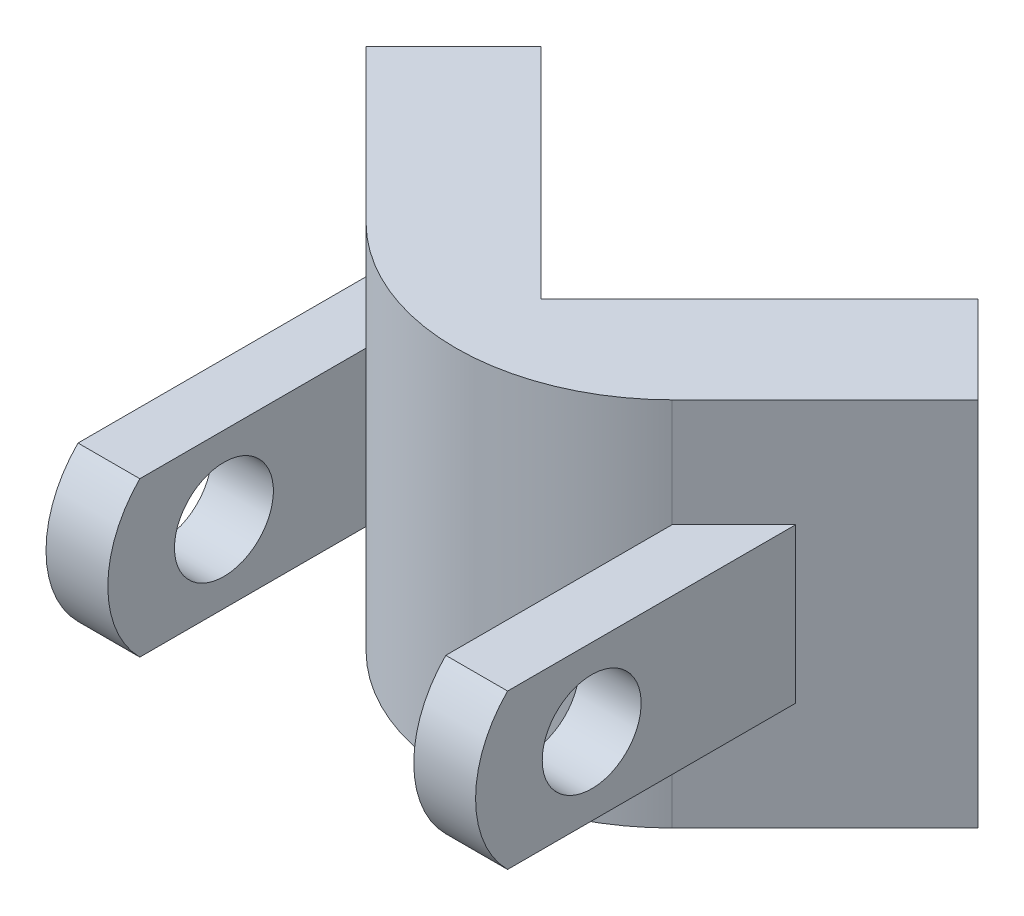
ISO-10303-21;
HEADER;
FILE_DESCRIPTION(('STEP AP214'),'2;1');
FILE_NAME('part.step','',(''),(''),'','','');
FILE_SCHEMA(('AUTOMOTIVE_DESIGN { 1 0 10303 214 1 1 1 1 }'));
ENDSEC;
DATA;
#1=APPLICATION_CONTEXT('core data for automotive mechanical design processes');
#2=APPLICATION_PROTOCOL_DEFINITION('international standard','automotive_design',2000,#1);
#3=PRODUCT_CONTEXT('',#1,'mechanical');
#4=PRODUCT('Part','Part','',(#3));
#5=PRODUCT_RELATED_PRODUCT_CATEGORY('part','',(#4));
#6=PRODUCT_DEFINITION_FORMATION('','',#4);
#7=PRODUCT_DEFINITION_CONTEXT('part definition',#1,'design');
#8=PRODUCT_DEFINITION('design','',#6,#7);
#9=PRODUCT_DEFINITION_SHAPE('','',#8);
#10=(LENGTH_UNIT() NAMED_UNIT(*) SI_UNIT(.MILLI.,.METRE.));
#11=(NAMED_UNIT(*) PLANE_ANGLE_UNIT() SI_UNIT($,.RADIAN.));
#12=(NAMED_UNIT(*) SI_UNIT($,.STERADIAN.) SOLID_ANGLE_UNIT());
#13=UNCERTAINTY_MEASURE_WITH_UNIT(LENGTH_MEASURE(1.E-05),#10,'distance_accuracy_value','');
#14=(GEOMETRIC_REPRESENTATION_CONTEXT(3) GLOBAL_UNCERTAINTY_ASSIGNED_CONTEXT((#13)) GLOBAL_UNIT_ASSIGNED_CONTEXT((#10,
#11,#12)) REPRESENTATION_CONTEXT('',''));
#15=CARTESIAN_POINT('',(0.,0.,0.));
#16=DIRECTION('',(0.,0.,1.));
#17=DIRECTION('',(1.,0.,0.));
#18=AXIS2_PLACEMENT_3D('',#15,#16,#17);
#19=CARTESIAN_POINT('',(0.,15.24,14.3684097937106));
#20=DIRECTION('',(-0.707106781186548,0.,0.707106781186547));
#21=DIRECTION('',(0.707106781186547,0.,0.707106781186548));
#22=AXIS2_PLACEMENT_3D('',#19,#20,#21);
#23=PLANE('',#22);
#24=DIRECTION('',(-0.707106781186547,0.,-0.707106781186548));
#25=VECTOR('',#24,1.);
#26=CARTESIAN_POINT('',(0.,-15.24,14.3684097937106));
#27=LINE('',#26,#25);
#28=CARTESIAN_POINT('',(-12.5723585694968,-15.24,1.79605122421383));
#29=VERTEX_POINT('',#28);
#30=CARTESIAN_POINT('',(-25.1447171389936,-15.24,-10.776307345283));
#31=VERTEX_POINT('',#30);
#32=EDGE_CURVE('E235',#29,#31,#27,.T.);
#33=ORIENTED_EDGE('',*,*,#32,.F.);
#34=DIRECTION('',(0.,1.,0.));
#35=VECTOR('',#34,1.);
#36=CARTESIAN_POINT('',(-12.5723585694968,-15.24,1.79605122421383));
#37=LINE('',#36,#35);
#38=CARTESIAN_POINT('',(-12.5723585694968,-6.35000000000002,1.79605122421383));
#39=VERTEX_POINT('',#38);
#40=EDGE_CURVE('E283',#29,#39,#37,.T.);
#41=ORIENTED_EDGE('',*,*,#40,.T.);
#42=DIRECTION('',(-0.707106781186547,0.,-0.707106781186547));
#43=VECTOR('',#42,1.);
#44=CARTESIAN_POINT('',(-17.6523585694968,-6.35000000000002,-3.28394877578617));
#45=LINE('',#44,#43);
#46=CARTESIAN_POINT('',(-17.6523585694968,-6.35000000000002,-3.28394877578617));
#47=VERTEX_POINT('',#46);
#48=EDGE_CURVE('E185',#39,#47,#45,.T.);
#49=ORIENTED_EDGE('',*,*,#48,.T.);
#50=DIRECTION('',(0.,-1.,0.));
#51=VECTOR('',#50,1.);
#52=CARTESIAN_POINT('',(-17.6523585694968,6.35000000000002,-3.28394877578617));
#53=LINE('',#52,#51);
#54=CARTESIAN_POINT('',(-17.6523585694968,6.35000000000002,-3.28394877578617));
#55=VERTEX_POINT('',#54);
#56=EDGE_CURVE('E196',#55,#47,#53,.T.);
#57=ORIENTED_EDGE('',*,*,#56,.F.);
#58=DIRECTION('',(-0.707106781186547,0.,-0.707106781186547));
#59=VECTOR('',#58,1.);
#60=CARTESIAN_POINT('',(-17.6523585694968,6.35000000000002,-3.28394877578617));
#61=LINE('',#60,#59);
#62=CARTESIAN_POINT('',(-12.5723585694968,6.35000000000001,1.79605122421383));
#63=VERTEX_POINT('',#62);
#64=EDGE_CURVE('E173',#63,#55,#61,.T.);
#65=ORIENTED_EDGE('',*,*,#64,.F.);
#66=CARTESIAN_POINT('',(-12.5723585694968,15.24,1.79605122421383));
#67=VERTEX_POINT('',#66);
#68=EDGE_CURVE('E289',#63,#67,#37,.T.);
#69=ORIENTED_EDGE('',*,*,#68,.T.);
#70=DIRECTION('',(-0.707106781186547,0.,-0.707106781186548));
#71=VECTOR('',#70,1.);
#72=CARTESIAN_POINT('',(0.,15.24,14.3684097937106));
#73=LINE('',#72,#71);
#74=CARTESIAN_POINT('',(-25.1447171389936,15.24,-10.776307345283));
#75=VERTEX_POINT('',#74);
#76=EDGE_CURVE('E213',#67,#75,#73,.T.);
#77=ORIENTED_EDGE('',*,*,#76,.T.);
#78=DIRECTION('',(0.,-1.,0.));
#79=VECTOR('',#78,1.);
#80=CARTESIAN_POINT('',(-25.1447171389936,15.24,-10.776307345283));
#81=LINE('',#80,#79);
#82=EDGE_CURVE('E252',#75,#31,#81,.T.);
#83=ORIENTED_EDGE('',*,*,#82,.T.);
#84=EDGE_LOOP('',(#33,#41,#49,#57,#65,#69,#77,#83));
#85=FACE_BOUND('',#84,.T.);
#86=ADVANCED_FACE('F44',(#85),#23,.T.);
#87=CARTESIAN_POINT('',(25.1447171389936,15.24,-10.776307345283));
#88=DIRECTION('',(0.707106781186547,0.,0.707106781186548));
#89=DIRECTION('',(0.707106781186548,0.,-0.707106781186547));
#90=AXIS2_PLACEMENT_3D('',#87,#88,#89);
#91=PLANE('',#90);
#92=DIRECTION('',(-0.707106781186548,0.,0.707106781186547));
#93=VECTOR('',#92,1.);
#94=CARTESIAN_POINT('',(25.1447171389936,15.24,-10.776307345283));
#95=LINE('',#94,#93);
#96=CARTESIAN_POINT('',(25.1447171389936,15.24,-10.776307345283));
#97=VERTEX_POINT('',#96);
#98=CARTESIAN_POINT('',(12.5723585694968,15.24,1.79605122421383));
#99=VERTEX_POINT('',#98);
#100=EDGE_CURVE('E209',#97,#99,#95,.T.);
#101=ORIENTED_EDGE('',*,*,#100,.T.);
#102=DIRECTION('',(0.,1.,0.));
#103=VECTOR('',#102,1.);
#104=CARTESIAN_POINT('',(12.5723585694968,-15.24,1.79605122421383));
#105=LINE('',#104,#103);
#106=CARTESIAN_POINT('',(12.5723585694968,6.35000000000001,1.79605122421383));
#107=VERTEX_POINT('',#106);
#108=EDGE_CURVE('E347',#107,#99,#105,.T.);
#109=ORIENTED_EDGE('',*,*,#108,.F.);
#110=DIRECTION('',(-0.707106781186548,0.,0.707106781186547));
#111=VECTOR('',#110,1.);
#112=CARTESIAN_POINT('',(25.1447171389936,6.35000000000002,-10.776307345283));
#113=LINE('',#112,#111);
#114=CARTESIAN_POINT('',(17.6523585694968,6.35000000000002,-3.28394877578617));
#115=VERTEX_POINT('',#114);
#116=EDGE_CURVE('E53',#115,#107,#113,.T.);
#117=ORIENTED_EDGE('',*,*,#116,.F.);
#118=DIRECTION('',(0.,-1.,0.));
#119=VECTOR('',#118,1.);
#120=CARTESIAN_POINT('',(17.6523585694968,15.24,-3.28394877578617));
#121=LINE('',#120,#119);
#122=CARTESIAN_POINT('',(17.6523585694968,-6.35000000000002,-3.28394877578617));
#123=VERTEX_POINT('',#122);
#124=EDGE_CURVE('E264',#115,#123,#121,.T.);
#125=ORIENTED_EDGE('',*,*,#124,.T.);
#126=DIRECTION('',(-0.707106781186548,0.,0.707106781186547));
#127=VECTOR('',#126,1.);
#128=CARTESIAN_POINT('',(25.1447171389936,-6.35000000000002,-10.776307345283));
#129=LINE('',#128,#127);
#130=CARTESIAN_POINT('',(12.5723585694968,-6.35000000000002,1.79605122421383));
#131=VERTEX_POINT('',#130);
#132=EDGE_CURVE('E248',#123,#131,#129,.T.);
#133=ORIENTED_EDGE('',*,*,#132,.T.);
#134=CARTESIAN_POINT('',(12.5723585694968,-15.24,1.79605122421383));
#135=VERTEX_POINT('',#134);
#136=EDGE_CURVE('E322',#135,#131,#105,.T.);
#137=ORIENTED_EDGE('',*,*,#136,.F.);
#138=DIRECTION('',(-0.707106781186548,0.,0.707106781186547));
#139=VECTOR('',#138,1.);
#140=CARTESIAN_POINT('',(25.1447171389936,-15.24,-10.776307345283));
#141=LINE('',#140,#139);
#142=CARTESIAN_POINT('',(25.1447171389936,-15.24,-10.776307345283));
#143=VERTEX_POINT('',#142);
#144=EDGE_CURVE('E231',#143,#135,#141,.T.);
#145=ORIENTED_EDGE('',*,*,#144,.F.);
#146=DIRECTION('',(0.,-1.,0.));
#147=VECTOR('',#146,1.);
#148=CARTESIAN_POINT('',(25.1447171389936,15.24,-10.776307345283));
#149=LINE('',#148,#147);
#150=EDGE_CURVE('E256',#97,#143,#149,.T.);
#151=ORIENTED_EDGE('',*,*,#150,.F.);
#152=EDGE_LOOP('',(#101,#109,#117,#125,#133,#137,#145,#151));
#153=FACE_BOUND('',#152,.T.);
#154=ADVANCED_FACE('F320',(#153),#91,.T.);
#155=CARTESIAN_POINT('',(0.,15.24,0.));
#156=DIRECTION('',(0.,-1.,0.));
#157=DIRECTION('',(0.,0.,-1.));
#158=AXIS2_PLACEMENT_3D('',#155,#156,#157);
#159=PLANE('',#158);
#160=CARTESIAN_POINT('',(0.,15.24,-10.7920889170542));
#161=DIRECTION('',(0.,1.,0.));
#162=DIRECTION('',(0.,0.,1.));
#163=AXIS2_PLACEMENT_3D('',#160,#161,#162);
#164=CIRCLE('',#163,17.7911627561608);
#165=EDGE_CURVE('E339',#67,#99,#164,.T.);
#166=ORIENTED_EDGE('',*,*,#165,.T.);
#167=ORIENTED_EDGE('',*,*,#100,.F.);
#168=DIRECTION('',(0.707106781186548,0.,0.707106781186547));
#169=VECTOR('',#168,1.);
#170=CARTESIAN_POINT('',(17.9605122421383,15.24,-17.9605122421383));
#171=LINE('',#170,#169);
#172=CARTESIAN_POINT('',(17.9605122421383,15.24,-17.9605122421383));
#173=VERTEX_POINT('',#172);
#174=EDGE_CURVE('E204',#173,#97,#171,.T.);
#175=ORIENTED_EDGE('',*,*,#174,.F.);
#176=DIRECTION('',(0.707106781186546,0.,-0.707106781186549));
#177=VECTOR('',#176,1.);
#178=CARTESIAN_POINT('',(0.,15.24,0.));
#179=LINE('',#178,#177);
#180=CARTESIAN_POINT('',(0.,15.24,0.));
#181=VERTEX_POINT('',#180);
#182=EDGE_CURVE('E200',#181,#173,#179,.T.);
#183=ORIENTED_EDGE('',*,*,#182,.F.);
#184=DIRECTION('',(-0.707106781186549,0.,-0.707106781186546));
#185=VECTOR('',#184,1.);
#186=CARTESIAN_POINT('',(0.,15.24,0.));
#187=LINE('',#186,#185);
#188=CARTESIAN_POINT('',(-17.9605122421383,15.24,-17.9605122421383));
#189=VERTEX_POINT('',#188);
#190=EDGE_CURVE('E220',#181,#189,#187,.T.);
#191=ORIENTED_EDGE('',*,*,#190,.T.);
#192=DIRECTION('',(0.707106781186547,0.,-0.707106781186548));
#193=VECTOR('',#192,1.);
#194=CARTESIAN_POINT('',(-25.1447171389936,15.24,-10.776307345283));
#195=LINE('',#194,#193);
#196=EDGE_CURVE('E216',#75,#189,#195,.T.);
#197=ORIENTED_EDGE('',*,*,#196,.F.);
#198=ORIENTED_EDGE('',*,*,#76,.F.);
#199=EDGE_LOOP('',(#166,#167,#175,#183,#191,#197,#198));
#200=FACE_BOUND('',#199,.T.);
#201=ADVANCED_FACE('F359',(#200),#159,.F.);
#202=CARTESIAN_POINT('',(0.,-15.24,0.));
#203=DIRECTION('',(0.,-1.,0.));
#204=DIRECTION('',(0.,0.,-1.));
#205=AXIS2_PLACEMENT_3D('',#202,#203,#204);
#206=PLANE('',#205);
#207=ORIENTED_EDGE('',*,*,#144,.T.);
#208=CARTESIAN_POINT('',(0.,-15.24,-10.7920889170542));
#209=DIRECTION('',(0.,1.,0.));
#210=DIRECTION('',(0.,0.,1.));
#211=AXIS2_PLACEMENT_3D('',#208,#209,#210);
#212=CIRCLE('',#211,17.7911627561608);
#213=EDGE_CURVE('E344',#29,#135,#212,.T.);
#214=ORIENTED_EDGE('',*,*,#213,.F.);
#215=ORIENTED_EDGE('',*,*,#32,.T.);
#216=DIRECTION('',(0.707106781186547,0.,-0.707106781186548));
#217=VECTOR('',#216,1.);
#218=CARTESIAN_POINT('',(-25.1447171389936,-15.24,-10.776307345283));
#219=LINE('',#218,#217);
#220=CARTESIAN_POINT('',(-17.9605122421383,-15.24,-17.9605122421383));
#221=VERTEX_POINT('',#220);
#222=EDGE_CURVE('E238',#31,#221,#219,.T.);
#223=ORIENTED_EDGE('',*,*,#222,.T.);
#224=DIRECTION('',(-0.707106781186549,0.,-0.707106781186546));
#225=VECTOR('',#224,1.);
#226=CARTESIAN_POINT('',(0.,-15.24,0.));
#227=LINE('',#226,#225);
#228=CARTESIAN_POINT('',(0.,-15.24,0.));
#229=VERTEX_POINT('',#228);
#230=EDGE_CURVE('E205',#229,#221,#227,.T.);
#231=ORIENTED_EDGE('',*,*,#230,.F.);
#232=DIRECTION('',(0.707106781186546,0.,-0.707106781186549));
#233=VECTOR('',#232,1.);
#234=CARTESIAN_POINT('',(0.,-15.24,0.));
#235=LINE('',#234,#233);
#236=CARTESIAN_POINT('',(17.9605122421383,-15.24,-17.9605122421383));
#237=VERTEX_POINT('',#236);
#238=EDGE_CURVE('E199',#229,#237,#235,.T.);
#239=ORIENTED_EDGE('',*,*,#238,.T.);
#240=DIRECTION('',(0.707106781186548,0.,0.707106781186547));
#241=VECTOR('',#240,1.);
#242=CARTESIAN_POINT('',(17.9605122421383,-15.24,-17.9605122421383));
#243=LINE('',#242,#241);
#244=EDGE_CURVE('E227',#237,#143,#243,.T.);
#245=ORIENTED_EDGE('',*,*,#244,.T.);
#246=EDGE_LOOP('',(#207,#214,#215,#223,#231,#239,#245));
#247=FACE_BOUND('',#246,.T.);
#248=ADVANCED_FACE('F422',(#247),#206,.T.);
#249=CARTESIAN_POINT('',(0.,15.24,0.));
#250=DIRECTION('',(-0.707106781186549,0.,-0.707106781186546));
#251=DIRECTION('',(-0.707106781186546,0.,0.707106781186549));
#252=AXIS2_PLACEMENT_3D('',#249,#250,#251);
#253=PLANE('',#252);
#254=ORIENTED_EDGE('',*,*,#238,.F.);
#255=DIRECTION('',(0.,-1.,0.));
#256=VECTOR('',#255,1.);
#257=CARTESIAN_POINT('',(0.,15.24,0.));
#258=LINE('',#257,#256);
#259=EDGE_CURVE('E245',#181,#229,#258,.T.);
#260=ORIENTED_EDGE('',*,*,#259,.F.);
#261=ORIENTED_EDGE('',*,*,#182,.T.);
#262=DIRECTION('',(0.,-1.,0.));
#263=VECTOR('',#262,1.);
#264=CARTESIAN_POINT('',(17.9605122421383,15.24,-17.9605122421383));
#265=LINE('',#264,#263);
#266=EDGE_CURVE('E223',#173,#237,#265,.T.);
#267=ORIENTED_EDGE('',*,*,#266,.T.);
#268=EDGE_LOOP('',(#254,#260,#261,#267));
#269=FACE_BOUND('',#268,.T.);
#270=ADVANCED_FACE('F46',(#269),#253,.T.);
#271=CARTESIAN_POINT('',(0.,15.24,0.));
#272=DIRECTION('',(-0.707106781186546,0.,0.707106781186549));
#273=DIRECTION('',(0.707106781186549,0.,0.707106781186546));
#274=AXIS2_PLACEMENT_3D('',#271,#272,#273);
#275=PLANE('',#274);
#276=ORIENTED_EDGE('',*,*,#230,.T.);
#277=DIRECTION('',(0.,-1.,0.));
#278=VECTOR('',#277,1.);
#279=CARTESIAN_POINT('',(-17.9605122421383,15.24,-17.9605122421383));
#280=LINE('',#279,#278);
#281=EDGE_CURVE('E249',#189,#221,#280,.T.);
#282=ORIENTED_EDGE('',*,*,#281,.F.);
#283=ORIENTED_EDGE('',*,*,#190,.F.);
#284=ORIENTED_EDGE('',*,*,#259,.T.);
#285=EDGE_LOOP('',(#276,#282,#283,#284));
#286=FACE_BOUND('',#285,.T.);
#287=ADVANCED_FACE('F372',(#286),#275,.F.);
#288=CARTESIAN_POINT('',(-25.1447171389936,15.24,-10.776307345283));
#289=DIRECTION('',(-0.707106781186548,0.,-0.707106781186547));
#290=DIRECTION('',(-0.707106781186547,0.,0.707106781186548));
#291=AXIS2_PLACEMENT_3D('',#288,#289,#290);
#292=PLANE('',#291);
#293=ORIENTED_EDGE('',*,*,#222,.F.);
#294=ORIENTED_EDGE('',*,*,#82,.F.);
#295=ORIENTED_EDGE('',*,*,#196,.T.);
#296=ORIENTED_EDGE('',*,*,#281,.T.);
#297=EDGE_LOOP('',(#293,#294,#295,#296));
#298=FACE_BOUND('',#297,.T.);
#299=ADVANCED_FACE('F376',(#298),#292,.T.);
#300=CARTESIAN_POINT('',(17.9605122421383,15.24,-17.9605122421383));
#301=DIRECTION('',(0.707106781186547,0.,-0.707106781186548));
#302=DIRECTION('',(-0.707106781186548,0.,-0.707106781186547));
#303=AXIS2_PLACEMENT_3D('',#300,#301,#302);
#304=PLANE('',#303);
#305=ORIENTED_EDGE('',*,*,#244,.F.);
#306=ORIENTED_EDGE('',*,*,#266,.F.);
#307=ORIENTED_EDGE('',*,*,#174,.T.);
#308=ORIENTED_EDGE('',*,*,#150,.T.);
#309=EDGE_LOOP('',(#305,#306,#307,#308));
#310=FACE_BOUND('',#309,.T.);
#311=ADVANCED_FACE('F364',(#310),#304,.T.);
#312=CARTESIAN_POINT('',(-17.6523585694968,6.35000000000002,24.6560512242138));
#313=DIRECTION('',(1.,0.,0.));
#314=DIRECTION('',(0.,0.,-1.));
#315=AXIS2_PLACEMENT_3D('',#312,#313,#314);
#316=PLANE('',#315);
#317=CARTESIAN_POINT('',(-17.6523585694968,0.,13.4800512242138));
#318=DIRECTION('',(-1.,0.,0.));
#319=DIRECTION('',(0.,0.,1.));
#320=AXIS2_PLACEMENT_3D('',#317,#318,#319);
#321=CIRCLE('',#320,4.064);
#322=CARTESIAN_POINT('',(-17.6523585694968,0.,17.5440512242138));
#323=VERTEX_POINT('',#322);
#324=EDGE_CURVE('E274',#323,#323,#321,.T.);
#325=ORIENTED_EDGE('',*,*,#324,.F.);
#326=EDGE_LOOP('',(#325));
#327=FACE_BOUND('',#326,.T.);
#328=DIRECTION('',(0.,0.,1.));
#329=VECTOR('',#328,1.);
#330=CARTESIAN_POINT('',(-17.6523585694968,-6.35000000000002,24.6560512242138));
#331=LINE('',#330,#329);
#332=CARTESIAN_POINT('',(-17.6523585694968,-6.35000000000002,20.3917774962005));
#333=VERTEX_POINT('',#332);
#334=EDGE_CURVE('E168',#47,#333,#331,.T.);
#335=ORIENTED_EDGE('',*,*,#334,.T.);
#336=CARTESIAN_POINT('',(-17.6523585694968,0.,14.0417774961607));
#337=DIRECTION('',(1.,0.,0.));
#338=DIRECTION('',(0.,0.,-1.));
#339=AXIS2_PLACEMENT_3D('',#336,#337,#338);
#340=CIRCLE('',#339,8.9802561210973);
#341=CARTESIAN_POINT('',(-17.6523585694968,6.35000000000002,20.3917774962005));
#342=VERTEX_POINT('',#341);
#343=EDGE_CURVE('E60',#342,#333,#340,.T.);
#344=ORIENTED_EDGE('',*,*,#343,.F.);
#345=DIRECTION('',(0.,0.,1.));
#346=VECTOR('',#345,1.);
#347=CARTESIAN_POINT('',(-17.6523585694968,6.35000000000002,24.6560512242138));
#348=LINE('',#347,#346);
#349=EDGE_CURVE('E165',#55,#342,#348,.T.);
#350=ORIENTED_EDGE('',*,*,#349,.F.);
#351=ORIENTED_EDGE('',*,*,#56,.T.);
#352=EDGE_LOOP('',(#335,#344,#350,#351));
#353=FACE_BOUND('',#352,.T.);
#354=ADVANCED_FACE('F163',(#327,#353),#316,.F.);
#355=CARTESIAN_POINT('',(-12.5723585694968,6.35000000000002,1.79605122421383));
#356=DIRECTION('',(-1.,0.,0.));
#357=DIRECTION('',(0.,0.,1.));
#358=AXIS2_PLACEMENT_3D('',#355,#356,#357);
#359=PLANE('',#358);
#360=CARTESIAN_POINT('',(-12.5723585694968,0.,13.4800512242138));
#361=DIRECTION('',(-1.,0.,0.));
#362=DIRECTION('',(0.,0.,1.));
#363=AXIS2_PLACEMENT_3D('',#360,#361,#362);
#364=CIRCLE('',#363,4.064);
#365=CARTESIAN_POINT('',(-12.5723585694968,0.,17.5440512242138));
#366=VERTEX_POINT('',#365);
#367=EDGE_CURVE('E280',#366,#366,#364,.T.);
#368=ORIENTED_EDGE('',*,*,#367,.T.);
#369=EDGE_LOOP('',(#368));
#370=FACE_BOUND('',#369,.T.);
#371=DIRECTION('',(0.,0.,-1.));
#372=VECTOR('',#371,1.);
#373=CARTESIAN_POINT('',(-12.5723585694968,6.35000000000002,1.79605122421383));
#374=LINE('',#373,#372);
#375=CARTESIAN_POINT('',(-12.5723585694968,6.35000000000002,20.3917774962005));
#376=VERTEX_POINT('',#375);
#377=EDGE_CURVE('E175',#376,#63,#374,.T.);
#378=ORIENTED_EDGE('',*,*,#377,.F.);
#379=CARTESIAN_POINT('',(-12.5723585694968,0.,14.0417774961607));
#380=DIRECTION('',(-1.,0.,0.));
#381=DIRECTION('',(0.,0.,1.));
#382=AXIS2_PLACEMENT_3D('',#379,#380,#381);
#383=CIRCLE('',#382,8.9802561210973);
#384=CARTESIAN_POINT('',(-12.5723585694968,-6.35000000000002,20.3917774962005));
#385=VERTEX_POINT('',#384);
#386=EDGE_CURVE('E152',#376,#385,#383,.F.);
#387=ORIENTED_EDGE('',*,*,#386,.T.);
#388=DIRECTION('',(0.,0.,-1.));
#389=VECTOR('',#388,1.);
#390=CARTESIAN_POINT('',(-12.5723585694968,-6.35000000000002,1.79605122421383));
#391=LINE('',#390,#389);
#392=EDGE_CURVE('E181',#385,#39,#391,.T.);
#393=ORIENTED_EDGE('',*,*,#392,.T.);
#394=DIRECTION('',(0.,-1.,0.));
#395=VECTOR('',#394,1.);
#396=CARTESIAN_POINT('',(-12.5723585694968,6.35000000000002,1.79605122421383));
#397=LINE('',#396,#395);
#398=EDGE_CURVE('E179',#63,#39,#397,.T.);
#399=ORIENTED_EDGE('',*,*,#398,.F.);
#400=EDGE_LOOP('',(#378,#387,#393,#399));
#401=FACE_BOUND('',#400,.T.);
#402=ADVANCED_FACE('F413',(#370,#401),#359,.F.);
#403=CARTESIAN_POINT('',(0.,6.35000000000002,0.));
#404=DIRECTION('',(0.,-1.,0.));
#405=DIRECTION('',(0.,0.,-1.));
#406=AXIS2_PLACEMENT_3D('',#403,#404,#405);
#407=PLANE('',#406);
#408=ORIENTED_EDGE('',*,*,#349,.T.);
#409=DIRECTION('',(-1.,0.,0.));
#410=VECTOR('',#409,1.);
#411=CARTESIAN_POINT('',(25.1447171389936,6.35000000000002,20.3917774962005));
#412=LINE('',#411,#410);
#413=EDGE_CURVE('E149',#376,#342,#412,.T.);
#414=ORIENTED_EDGE('',*,*,#413,.F.);
#415=ORIENTED_EDGE('',*,*,#377,.T.);
#416=ORIENTED_EDGE('',*,*,#64,.T.);
#417=EDGE_LOOP('',(#408,#414,#415,#416));
#418=FACE_BOUND('',#417,.T.);
#419=ADVANCED_FACE('F171',(#418),#407,.F.);
#420=CARTESIAN_POINT('',(0.,-6.35000000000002,0.));
#421=DIRECTION('',(0.,-1.,0.));
#422=DIRECTION('',(0.,0.,-1.));
#423=AXIS2_PLACEMENT_3D('',#420,#421,#422);
#424=PLANE('',#423);
#425=DIRECTION('',(-1.,0.,0.));
#426=VECTOR('',#425,1.);
#427=CARTESIAN_POINT('',(25.1447171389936,-6.35000000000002,20.3917774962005));
#428=LINE('',#427,#426);
#429=EDGE_CURVE('E158',#385,#333,#428,.T.);
#430=ORIENTED_EDGE('',*,*,#429,.T.);
#431=ORIENTED_EDGE('',*,*,#334,.F.);
#432=ORIENTED_EDGE('',*,*,#48,.F.);
#433=ORIENTED_EDGE('',*,*,#392,.F.);
#434=EDGE_LOOP('',(#430,#431,#432,#433));
#435=FACE_BOUND('',#434,.T.);
#436=ADVANCED_FACE('F385',(#435),#424,.T.);
#437=CARTESIAN_POINT('',(17.6523585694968,6.35000000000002,24.6560512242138));
#438=DIRECTION('',(-1.,0.,0.));
#439=DIRECTION('',(0.,0.,1.));
#440=AXIS2_PLACEMENT_3D('',#437,#438,#439);
#441=PLANE('',#440);
#442=CARTESIAN_POINT('',(17.6523585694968,0.,13.4800512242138));
#443=DIRECTION('',(-1.,0.,0.));
#444=DIRECTION('',(0.,0.,1.));
#445=AXIS2_PLACEMENT_3D('',#442,#443,#444);
#446=CIRCLE('',#445,4.064);
#447=CARTESIAN_POINT('',(17.6523585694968,0.,17.5440512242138));
#448=VERTEX_POINT('',#447);
#449=EDGE_CURVE('E273',#448,#448,#446,.T.);
#450=ORIENTED_EDGE('',*,*,#449,.T.);
#451=EDGE_LOOP('',(#450));
#452=FACE_BOUND('',#451,.T.);
#453=DIRECTION('',(0.,0.,-1.));
#454=VECTOR('',#453,1.);
#455=CARTESIAN_POINT('',(17.6523585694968,6.35000000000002,24.6560512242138));
#456=LINE('',#455,#454);
#457=CARTESIAN_POINT('',(17.6523585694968,6.35000000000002,20.3917774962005));
#458=VERTEX_POINT('',#457);
#459=EDGE_CURVE('E297',#458,#115,#456,.T.);
#460=ORIENTED_EDGE('',*,*,#459,.F.);
#461=CARTESIAN_POINT('',(17.6523585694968,0.,14.0417774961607));
#462=DIRECTION('',(-1.,0.,0.));
#463=DIRECTION('',(0.,0.,1.));
#464=AXIS2_PLACEMENT_3D('',#461,#462,#463);
#465=CIRCLE('',#464,8.9802561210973);
#466=CARTESIAN_POINT('',(17.6523585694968,-6.35000000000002,20.3917774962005));
#467=VERTEX_POINT('',#466);
#468=EDGE_CURVE('E330',#458,#467,#465,.F.);
#469=ORIENTED_EDGE('',*,*,#468,.T.);
#470=DIRECTION('',(0.,0.,-1.));
#471=VECTOR('',#470,1.);
#472=CARTESIAN_POINT('',(17.6523585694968,-6.35000000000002,24.6560512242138));
#473=LINE('',#472,#471);
#474=EDGE_CURVE('E296',#467,#123,#473,.T.);
#475=ORIENTED_EDGE('',*,*,#474,.T.);
#476=ORIENTED_EDGE('',*,*,#124,.F.);
#477=EDGE_LOOP('',(#460,#469,#475,#476));
#478=FACE_BOUND('',#477,.T.);
#479=ADVANCED_FACE('F334',(#452,#478),#441,.F.);
#480=CARTESIAN_POINT('',(12.5723585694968,6.35000000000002,1.79605122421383));
#481=DIRECTION('',(1.,0.,0.));
#482=DIRECTION('',(0.,0.,-1.));
#483=AXIS2_PLACEMENT_3D('',#480,#481,#482);
#484=PLANE('',#483);
#485=CARTESIAN_POINT('',(12.5723585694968,0.,13.4800512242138));
#486=DIRECTION('',(1.,0.,0.));
#487=DIRECTION('',(0.,0.,-1.));
#488=AXIS2_PLACEMENT_3D('',#485,#486,#487);
#489=CIRCLE('',#488,4.064);
#490=CARTESIAN_POINT('',(12.5723585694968,0.,17.5440512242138));
#491=VERTEX_POINT('',#490);
#492=EDGE_CURVE('E270',#491,#491,#489,.T.);
#493=ORIENTED_EDGE('',*,*,#492,.T.);
#494=EDGE_LOOP('',(#493));
#495=FACE_BOUND('',#494,.T.);
#496=DIRECTION('',(0.,0.,1.));
#497=VECTOR('',#496,1.);
#498=CARTESIAN_POINT('',(12.5723585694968,-6.35000000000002,1.79605122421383));
#499=LINE('',#498,#497);
#500=CARTESIAN_POINT('',(12.5723585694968,-6.35000000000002,20.3917774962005));
#501=VERTEX_POINT('',#500);
#502=EDGE_CURVE('E301',#131,#501,#499,.T.);
#503=ORIENTED_EDGE('',*,*,#502,.T.);
#504=CARTESIAN_POINT('',(12.5723585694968,0.,14.0417774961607));
#505=DIRECTION('',(1.,0.,0.));
#506=DIRECTION('',(0.,0.,-1.));
#507=AXIS2_PLACEMENT_3D('',#504,#505,#506);
#508=CIRCLE('',#507,8.9802561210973);
#509=CARTESIAN_POINT('',(12.5723585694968,6.35000000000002,20.3917774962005));
#510=VERTEX_POINT('',#509);
#511=EDGE_CURVE('E68',#501,#510,#508,.F.);
#512=ORIENTED_EDGE('',*,*,#511,.T.);
#513=DIRECTION('',(0.,0.,1.));
#514=VECTOR('',#513,1.);
#515=CARTESIAN_POINT('',(12.5723585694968,6.35000000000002,1.79605122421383));
#516=LINE('',#515,#514);
#517=EDGE_CURVE('E300',#107,#510,#516,.T.);
#518=ORIENTED_EDGE('',*,*,#517,.F.);
#519=DIRECTION('',(0.,-1.,0.));
#520=VECTOR('',#519,1.);
#521=CARTESIAN_POINT('',(12.5723585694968,6.35000000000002,1.79605122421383));
#522=LINE('',#521,#520);
#523=EDGE_CURVE('E188',#107,#131,#522,.T.);
#524=ORIENTED_EDGE('',*,*,#523,.T.);
#525=EDGE_LOOP('',(#503,#512,#518,#524));
#526=FACE_BOUND('',#525,.T.);
#527=ADVANCED_FACE('F313',(#495,#526),#484,.F.);
#528=CARTESIAN_POINT('',(0.,6.35000000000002,0.));
#529=DIRECTION('',(0.,1.,0.));
#530=DIRECTION('',(0.,0.,1.));
#531=AXIS2_PLACEMENT_3D('',#528,#529,#530);
#532=PLANE('',#531);
#533=EDGE_CURVE('E157',#458,#510,#412,.T.);
#534=ORIENTED_EDGE('',*,*,#533,.F.);
#535=ORIENTED_EDGE('',*,*,#459,.T.);
#536=ORIENTED_EDGE('',*,*,#116,.T.);
#537=ORIENTED_EDGE('',*,*,#517,.T.);
#538=EDGE_LOOP('',(#534,#535,#536,#537));
#539=FACE_BOUND('',#538,.T.);
#540=ADVANCED_FACE('F389',(#539),#532,.T.);
#541=CARTESIAN_POINT('',(0.,-6.35000000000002,0.));
#542=DIRECTION('',(0.,1.,0.));
#543=DIRECTION('',(0.,0.,1.));
#544=AXIS2_PLACEMENT_3D('',#541,#542,#543);
#545=PLANE('',#544);
#546=ORIENTED_EDGE('',*,*,#474,.F.);
#547=DIRECTION('',(-1.,0.,0.));
#548=VECTOR('',#547,1.);
#549=CARTESIAN_POINT('',(25.1447171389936,-6.35000000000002,20.3917774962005));
#550=LINE('',#549,#548);
#551=EDGE_CURVE('E11',#467,#501,#550,.T.);
#552=ORIENTED_EDGE('',*,*,#551,.T.);
#553=ORIENTED_EDGE('',*,*,#502,.F.);
#554=ORIENTED_EDGE('',*,*,#132,.F.);
#555=EDGE_LOOP('',(#546,#552,#553,#554));
#556=FACE_BOUND('',#555,.T.);
#557=ADVANCED_FACE('F327',(#556),#545,.F.);
#558=CARTESIAN_POINT('',(25.1447171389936,0.,13.4800512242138));
#559=DIRECTION('',(-1.,0.,0.));
#560=DIRECTION('',(0.,0.,1.));
#561=AXIS2_PLACEMENT_3D('',#558,#559,#560);
#562=CYLINDRICAL_SURFACE('',#561,4.064);
#563=CARTESIAN_POINT('',(12.5723585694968,0.,17.5440512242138));
#564=CARTESIAN_POINT('',(12.6252752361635,0.,17.5440512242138));
#565=CARTESIAN_POINT('',(12.6781919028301,0.,17.5440512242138));
#566=CARTESIAN_POINT('',(12.7840252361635,0.,17.5440512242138));
#567=CARTESIAN_POINT('',(12.8369419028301,0.,17.5440512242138));
#568=CARTESIAN_POINT('',(12.9427752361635,0.,17.5440512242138));
#569=CARTESIAN_POINT('',(12.9956919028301,0.,17.5440512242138));
#570=CARTESIAN_POINT('',(13.1015252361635,0.,17.5440512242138));
#571=CARTESIAN_POINT('',(13.1544419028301,0.,17.5440512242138));
#572=CARTESIAN_POINT('',(13.2602752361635,0.,17.5440512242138));
#573=CARTESIAN_POINT('',(13.3131919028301,0.,17.5440512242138));
#574=CARTESIAN_POINT('',(13.4190252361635,0.,17.5440512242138));
#575=CARTESIAN_POINT('',(13.4719419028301,0.,17.5440512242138));
#576=CARTESIAN_POINT('',(13.5777752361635,0.,17.5440512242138));
#577=CARTESIAN_POINT('',(13.6306919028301,0.,17.5440512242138));
#578=CARTESIAN_POINT('',(13.7365252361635,0.,17.5440512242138));
#579=CARTESIAN_POINT('',(13.7894419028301,0.,17.5440512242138));
#580=CARTESIAN_POINT('',(13.8952752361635,0.,17.5440512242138));
#581=CARTESIAN_POINT('',(13.9481919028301,0.,17.5440512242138));
#582=CARTESIAN_POINT('',(14.0540252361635,0.,17.5440512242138));
#583=CARTESIAN_POINT('',(14.1069419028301,0.,17.5440512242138));
#584=CARTESIAN_POINT('',(14.2127752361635,0.,17.5440512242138));
#585=CARTESIAN_POINT('',(14.2656919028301,0.,17.5440512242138));
#586=CARTESIAN_POINT('',(14.3715252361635,0.,17.5440512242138));
#587=CARTESIAN_POINT('',(14.4244419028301,0.,17.5440512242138));
#588=CARTESIAN_POINT('',(14.5302752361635,0.,17.5440512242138));
#589=CARTESIAN_POINT('',(14.5831919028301,0.,17.5440512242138));
#590=CARTESIAN_POINT('',(14.6890252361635,0.,17.5440512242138));
#591=CARTESIAN_POINT('',(14.7419419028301,0.,17.5440512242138));
#592=CARTESIAN_POINT('',(14.8477752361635,0.,17.5440512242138));
#593=CARTESIAN_POINT('',(14.9006919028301,0.,17.5440512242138));
#594=CARTESIAN_POINT('',(15.0065252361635,0.,17.5440512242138));
#595=CARTESIAN_POINT('',(15.0594419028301,0.,17.5440512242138));
#596=CARTESIAN_POINT('',(15.1652752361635,0.,17.5440512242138));
#597=CARTESIAN_POINT('',(15.2181919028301,0.,17.5440512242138));
#598=CARTESIAN_POINT('',(15.3240252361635,0.,17.5440512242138));
#599=CARTESIAN_POINT('',(15.3769419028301,0.,17.5440512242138));
#600=CARTESIAN_POINT('',(15.4827752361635,0.,17.5440512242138));
#601=CARTESIAN_POINT('',(15.5356919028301,0.,17.5440512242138));
#602=CARTESIAN_POINT('',(15.6415252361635,0.,17.5440512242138));
#603=CARTESIAN_POINT('',(15.6944419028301,0.,17.5440512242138));
#604=CARTESIAN_POINT('',(15.8002752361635,0.,17.5440512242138));
#605=CARTESIAN_POINT('',(15.8531919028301,0.,17.5440512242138));
#606=CARTESIAN_POINT('',(15.9590252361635,0.,17.5440512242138));
#607=CARTESIAN_POINT('',(16.0119419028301,0.,17.5440512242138));
#608=CARTESIAN_POINT('',(16.1177752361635,0.,17.5440512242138));
#609=CARTESIAN_POINT('',(16.1706919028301,0.,17.5440512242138));
#610=CARTESIAN_POINT('',(16.2765252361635,0.,17.5440512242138));
#611=CARTESIAN_POINT('',(16.3294419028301,0.,17.5440512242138));
#612=CARTESIAN_POINT('',(16.4352752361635,0.,17.5440512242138));
#613=CARTESIAN_POINT('',(16.4881919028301,0.,17.5440512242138));
#614=CARTESIAN_POINT('',(16.5940252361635,0.,17.5440512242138));
#615=CARTESIAN_POINT('',(16.6469419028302,0.,17.5440512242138));
#616=CARTESIAN_POINT('',(16.7527752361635,0.,17.5440512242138));
#617=CARTESIAN_POINT('',(16.8056919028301,0.,17.5440512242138));
#618=CARTESIAN_POINT('',(16.9115252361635,0.,17.5440512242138));
#619=CARTESIAN_POINT('',(16.9644419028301,0.,17.5440512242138));
#620=CARTESIAN_POINT('',(17.0702752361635,0.,17.5440512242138));
#621=CARTESIAN_POINT('',(17.1231919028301,0.,17.5440512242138));
#622=CARTESIAN_POINT('',(17.2290252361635,0.,17.5440512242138));
#623=CARTESIAN_POINT('',(17.2819419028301,0.,17.5440512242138));
#624=CARTESIAN_POINT('',(17.3877752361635,0.,17.5440512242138));
#625=CARTESIAN_POINT('',(17.4406919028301,0.,17.5440512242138));
#626=CARTESIAN_POINT('',(17.5465252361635,0.,17.5440512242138));
#627=CARTESIAN_POINT('',(17.5994419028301,0.,17.5440512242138));
#628=CARTESIAN_POINT('',(17.6523585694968,0.,17.5440512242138));
#629=B_SPLINE_CURVE_WITH_KNOTS('',3,(#563,#564,#565,#566,#567,#568,#569,#570,#571,#572,#573,
#574,#575,#576,#577,#578,#579,#580,#581,#582,#583,#584,#585,#586,#587,#588,#589,#590,#591,#592,
#593,#594,#595,#596,#597,#598,#599,#600,#601,#602,#603,#604,#605,#606,#607,#608,#609,#610,#611,
#612,#613,#614,#615,#616,#617,#618,#619,#620,#621,#622,#623,#624,#625,#626,#627,#628),
.UNSPECIFIED.,.F.,.F.,(4,2,2,2,2,2,2,2,2,2,2,2,2,2,2,2,2,2,2,2,2,2,2,2,2,2,2,2,2,2,2,2,4),(0.,
0.158750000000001,0.3175,0.476250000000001,0.635,0.793750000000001,0.9525,1.11125,1.27,1.42875,
1.5875,1.74625,1.905,2.06375,2.2225,2.38125,2.54,2.69875,2.8575,3.01625,3.175,3.33375,3.4925,
3.65125,3.81,3.96875000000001,4.1275,4.28625,4.445,4.60375,4.7625,4.92125,5.08),.UNSPECIFIED.);
#630=EDGE_CURVE('BSEAM396',#491,#448,#629,.T.);
#631=ORIENTED_EDGE('',*,*,#492,.F.);
#632=ORIENTED_EDGE('',*,*,#449,.F.);
#633=ORIENTED_EDGE('',*,*,#630,.T.);
#634=ORIENTED_EDGE('',*,*,#630,.F.);
#635=EDGE_LOOP('',(#631,#633,#632,#634));
#636=FACE_BOUND('',#635,.T.);
#637=ADVANCED_FACE('F396',(#636),#562,.F.);
#638=CARTESIAN_POINT('',(-17.6523585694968,0.,17.5440512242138));
#639=CARTESIAN_POINT('',(-17.5994419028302,0.,17.5440512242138));
#640=CARTESIAN_POINT('',(-17.5465252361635,0.,17.5440512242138));
#641=CARTESIAN_POINT('',(-17.4406919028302,0.,17.5440512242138));
#642=CARTESIAN_POINT('',(-17.3877752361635,0.,17.5440512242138));
#643=CARTESIAN_POINT('',(-17.2819419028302,0.,17.5440512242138));
#644=CARTESIAN_POINT('',(-17.2290252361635,0.,17.5440512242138));
#645=CARTESIAN_POINT('',(-17.1231919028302,0.,17.5440512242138));
#646=CARTESIAN_POINT('',(-17.0702752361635,0.,17.5440512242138));
#647=CARTESIAN_POINT('',(-16.9644419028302,0.,17.5440512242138));
#648=CARTESIAN_POINT('',(-16.9115252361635,0.,17.5440512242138));
#649=CARTESIAN_POINT('',(-16.8056919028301,0.,17.5440512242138));
#650=CARTESIAN_POINT('',(-16.7527752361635,0.,17.5440512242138));
#651=CARTESIAN_POINT('',(-16.6469419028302,0.,17.5440512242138));
#652=CARTESIAN_POINT('',(-16.5940252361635,0.,17.5440512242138));
#653=CARTESIAN_POINT('',(-16.4881919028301,0.,17.5440512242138));
#654=CARTESIAN_POINT('',(-16.4352752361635,0.,17.5440512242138));
#655=CARTESIAN_POINT('',(-16.3294419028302,0.,17.5440512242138));
#656=CARTESIAN_POINT('',(-16.2765252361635,0.,17.5440512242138));
#657=CARTESIAN_POINT('',(-16.1706919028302,0.,17.5440512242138));
#658=CARTESIAN_POINT('',(-16.1177752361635,0.,17.5440512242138));
#659=CARTESIAN_POINT('',(-16.0119419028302,0.,17.5440512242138));
#660=CARTESIAN_POINT('',(-15.9590252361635,0.,17.5440512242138));
#661=CARTESIAN_POINT('',(-15.8531919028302,0.,17.5440512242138));
#662=CARTESIAN_POINT('',(-15.8002752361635,0.,17.5440512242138));
#663=CARTESIAN_POINT('',(-15.6944419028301,0.,17.5440512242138));
#664=CARTESIAN_POINT('',(-15.6415252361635,0.,17.5440512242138));
#665=CARTESIAN_POINT('',(-15.5356919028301,0.,17.5440512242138));
#666=CARTESIAN_POINT('',(-15.4827752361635,0.,17.5440512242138));
#667=CARTESIAN_POINT('',(-15.3769419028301,0.,17.5440512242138));
#668=CARTESIAN_POINT('',(-15.3240252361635,0.,17.5440512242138));
#669=CARTESIAN_POINT('',(-15.2181919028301,0.,17.5440512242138));
#670=CARTESIAN_POINT('',(-15.1652752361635,0.,17.5440512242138));
#671=CARTESIAN_POINT('',(-15.0594419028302,0.,17.5440512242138));
#672=CARTESIAN_POINT('',(-15.0065252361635,0.,17.5440512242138));
#673=CARTESIAN_POINT('',(-14.9006919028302,0.,17.5440512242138));
#674=CARTESIAN_POINT('',(-14.8477752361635,0.,17.5440512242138));
#675=CARTESIAN_POINT('',(-14.7419419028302,0.,17.5440512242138));
#676=CARTESIAN_POINT('',(-14.6890252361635,0.,17.5440512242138));
#677=CARTESIAN_POINT('',(-14.5831919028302,0.,17.5440512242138));
#678=CARTESIAN_POINT('',(-14.5302752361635,0.,17.5440512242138));
#679=CARTESIAN_POINT('',(-14.4244419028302,0.,17.5440512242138));
#680=CARTESIAN_POINT('',(-14.3715252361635,0.,17.5440512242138));
#681=CARTESIAN_POINT('',(-14.2656919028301,0.,17.5440512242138));
#682=CARTESIAN_POINT('',(-14.2127752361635,0.,17.5440512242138));
#683=CARTESIAN_POINT('',(-14.1069419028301,0.,17.5440512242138));
#684=CARTESIAN_POINT('',(-14.0540252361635,0.,17.5440512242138));
#685=CARTESIAN_POINT('',(-13.9481919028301,0.,17.5440512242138));
#686=CARTESIAN_POINT('',(-13.8952752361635,0.,17.5440512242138));
#687=CARTESIAN_POINT('',(-13.7894419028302,0.,17.5440512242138));
#688=CARTESIAN_POINT('',(-13.7365252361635,0.,17.5440512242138));
#689=CARTESIAN_POINT('',(-13.6306919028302,0.,17.5440512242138));
#690=CARTESIAN_POINT('',(-13.5777752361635,0.,17.5440512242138));
#691=CARTESIAN_POINT('',(-13.4719419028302,0.,17.5440512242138));
#692=CARTESIAN_POINT('',(-13.4190252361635,0.,17.5440512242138));
#693=CARTESIAN_POINT('',(-13.3131919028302,0.,17.5440512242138));
#694=CARTESIAN_POINT('',(-13.2602752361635,0.,17.5440512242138));
#695=CARTESIAN_POINT('',(-13.1544419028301,0.,17.5440512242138));
#696=CARTESIAN_POINT('',(-13.1015252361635,0.,17.5440512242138));
#697=CARTESIAN_POINT('',(-12.9956919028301,0.,17.5440512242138));
#698=CARTESIAN_POINT('',(-12.9427752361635,0.,17.5440512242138));
#699=CARTESIAN_POINT('',(-12.8369419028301,0.,17.5440512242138));
#700=CARTESIAN_POINT('',(-12.7840252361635,0.,17.5440512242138));
#701=CARTESIAN_POINT('',(-12.6781919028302,0.,17.5440512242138));
#702=CARTESIAN_POINT('',(-12.6252752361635,0.,17.5440512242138));
#703=CARTESIAN_POINT('',(-12.5723585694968,0.,17.5440512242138));
#704=B_SPLINE_CURVE_WITH_KNOTS('',3,(#638,#639,#640,#641,#642,#643,#644,#645,#646,#647,#648,
#649,#650,#651,#652,#653,#654,#655,#656,#657,#658,#659,#660,#661,#662,#663,#664,#665,#666,#667,
#668,#669,#670,#671,#672,#673,#674,#675,#676,#677,#678,#679,#680,#681,#682,#683,#684,#685,#686,
#687,#688,#689,#690,#691,#692,#693,#694,#695,#696,#697,#698,#699,#700,#701,#702,#703),
.UNSPECIFIED.,.F.,.F.,(4,2,2,2,2,2,2,2,2,2,2,2,2,2,2,2,2,2,2,2,2,2,2,2,2,2,2,2,2,2,2,2,4),(0.,
0.158749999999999,0.317499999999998,0.476249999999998,0.634999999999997,0.793750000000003,
0.952500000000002,1.11125,1.27,1.42875,1.5875,1.74625,1.905,2.06375,2.2225,2.38125,2.54,2.69875,
2.8575,3.01625,3.175,3.33375,3.4925,3.65125,3.81,3.96875,4.1275,4.28625,4.445,4.60375,4.7625,
4.92125,5.08),.UNSPECIFIED.);
#705=EDGE_CURVE('BSEAM443',#323,#366,#704,.T.);
#706=ORIENTED_EDGE('',*,*,#324,.T.);
#707=ORIENTED_EDGE('',*,*,#367,.F.);
#708=ORIENTED_EDGE('',*,*,#705,.T.);
#709=ORIENTED_EDGE('',*,*,#705,.F.);
#710=EDGE_LOOP('',(#706,#708,#707,#709));
#711=FACE_BOUND('',#710,.T.);
#712=ADVANCED_FACE('F443',(#711),#562,.F.);
#713=CARTESIAN_POINT('',(0.,-15.24,-10.7920889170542));
#714=DIRECTION('',(0.,1.,0.));
#715=DIRECTION('',(0.,0.,1.));
#716=AXIS2_PLACEMENT_3D('',#713,#714,#715);
#717=CYLINDRICAL_SURFACE('',#716,17.7911627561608);
#718=ORIENTED_EDGE('',*,*,#165,.F.);
#719=ORIENTED_EDGE('',*,*,#68,.F.);
#720=ORIENTED_EDGE('',*,*,#398,.T.);
#721=ORIENTED_EDGE('',*,*,#40,.F.);
#722=ORIENTED_EDGE('',*,*,#213,.T.);
#723=ORIENTED_EDGE('',*,*,#136,.T.);
#724=ORIENTED_EDGE('',*,*,#523,.F.);
#725=ORIENTED_EDGE('',*,*,#108,.T.);
#726=EDGE_LOOP('',(#718,#719,#720,#721,#722,#723,#724,#725));
#727=FACE_BOUND('',#726,.T.);
#728=ADVANCED_FACE('F354',(#727),#717,.T.);
#729=CARTESIAN_POINT('',(25.1447171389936,0.,14.0417774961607));
#730=DIRECTION('',(-1.,0.,0.));
#731=DIRECTION('',(0.,0.,1.));
#732=AXIS2_PLACEMENT_3D('',#729,#730,#731);
#733=CYLINDRICAL_SURFACE('',#732,8.9802561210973);
#734=ORIENTED_EDGE('',*,*,#533,.T.);
#735=ORIENTED_EDGE('',*,*,#511,.F.);
#736=ORIENTED_EDGE('',*,*,#551,.F.);
#737=ORIENTED_EDGE('',*,*,#468,.F.);
#738=EDGE_LOOP('',(#734,#735,#736,#737));
#739=FACE_BOUND('',#738,.T.);
#740=ADVANCED_FACE('F329',(#739),#733,.T.);
#741=ORIENTED_EDGE('',*,*,#413,.T.);
#742=ORIENTED_EDGE('',*,*,#343,.T.);
#743=ORIENTED_EDGE('',*,*,#429,.F.);
#744=ORIENTED_EDGE('',*,*,#386,.F.);
#745=EDGE_LOOP('',(#741,#742,#743,#744));
#746=FACE_BOUND('',#745,.T.);
#747=ADVANCED_FACE('F150',(#746),#733,.T.);
#748=CLOSED_SHELL('',(#86,#154,#201,#248,#270,#287,#299,#311,#354,#402,#419,#436,#479,#527,#540,
#557,#637,#712,#728,#740,#747));
#749=MANIFOLD_SOLID_BREP('B2',#748);
#750=ADVANCED_BREP_SHAPE_REPRESENTATION('',(#18,#749),#14);
#751=SHAPE_DEFINITION_REPRESENTATION(#9,#750);
ENDSEC;
END-ISO-10303-21;
